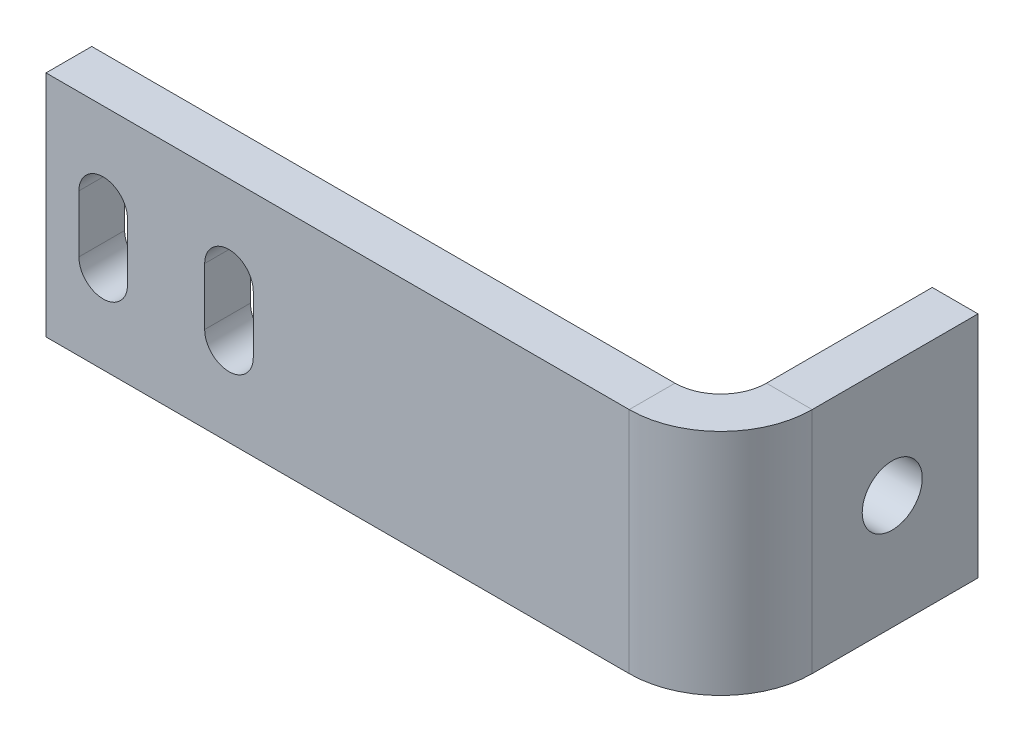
ISO-10303-21;
HEADER;
FILE_DESCRIPTION(('STEP AP214'),'2;1');
FILE_NAME('part.step','',(''),(''),'','','');
FILE_SCHEMA(('AUTOMOTIVE_DESIGN { 1 0 10303 214 1 1 1 1 }'));
ENDSEC;
DATA;
#1=APPLICATION_CONTEXT('core data for automotive mechanical design processes');
#2=APPLICATION_PROTOCOL_DEFINITION('international standard','automotive_design',2000,#1);
#3=PRODUCT_CONTEXT('',#1,'mechanical');
#4=PRODUCT('Part','Part','',(#3));
#5=PRODUCT_RELATED_PRODUCT_CATEGORY('part','',(#4));
#6=PRODUCT_DEFINITION_FORMATION('','',#4);
#7=PRODUCT_DEFINITION_CONTEXT('part definition',#1,'design');
#8=PRODUCT_DEFINITION('design','',#6,#7);
#9=PRODUCT_DEFINITION_SHAPE('','',#8);
#10=(LENGTH_UNIT() NAMED_UNIT(*) SI_UNIT(.MILLI.,.METRE.));
#11=(NAMED_UNIT(*) PLANE_ANGLE_UNIT() SI_UNIT($,.RADIAN.));
#12=(NAMED_UNIT(*) SI_UNIT($,.STERADIAN.) SOLID_ANGLE_UNIT());
#13=UNCERTAINTY_MEASURE_WITH_UNIT(LENGTH_MEASURE(1.E-05),#10,'distance_accuracy_value','');
#14=(GEOMETRIC_REPRESENTATION_CONTEXT(3) GLOBAL_UNCERTAINTY_ASSIGNED_CONTEXT((#13)) GLOBAL_UNIT_ASSIGNED_CONTEXT((#10,
#11,#12)) REPRESENTATION_CONTEXT('',''));
#15=CARTESIAN_POINT('',(0.,0.,0.));
#16=DIRECTION('',(0.,0.,1.));
#17=DIRECTION('',(1.,0.,0.));
#18=AXIS2_PLACEMENT_3D('',#15,#16,#17);
#19=CARTESIAN_POINT('',(0.,-20.,8.));
#20=DIRECTION('',(0.,1.,0.));
#21=DIRECTION('',(0.,0.,1.));
#22=AXIS2_PLACEMENT_3D('',#19,#20,#21);
#23=PLANE('',#22);
#24=DIRECTION('',(0.,0.,1.));
#25=VECTOR('',#24,1.);
#26=CARTESIAN_POINT('',(102.,-20.,0.));
#27=LINE('',#26,#25);
#28=CARTESIAN_POINT('',(102.,-20.,0.));
#29=VERTEX_POINT('',#28);
#30=CARTESIAN_POINT('',(102.,-20.,8.));
#31=VERTEX_POINT('',#30);
#32=EDGE_CURVE('E331',#29,#31,#27,.T.);
#33=ORIENTED_EDGE('',*,*,#32,.T.);
#34=DIRECTION('',(1.,0.,0.));
#35=VECTOR('',#34,1.);
#36=CARTESIAN_POINT('',(0.,-20.,8.));
#37=LINE('',#36,#35);
#38=CARTESIAN_POINT('',(0.,-20.,8.));
#39=VERTEX_POINT('',#38);
#40=EDGE_CURVE('E357',#39,#31,#37,.T.);
#41=ORIENTED_EDGE('',*,*,#40,.F.);
#42=DIRECTION('',(0.,0.,-1.));
#43=VECTOR('',#42,1.);
#44=CARTESIAN_POINT('',(0.,-20.,8.));
#45=LINE('',#44,#43);
#46=CARTESIAN_POINT('',(0.,-20.,0.));
#47=VERTEX_POINT('',#46);
#48=EDGE_CURVE('E13',#39,#47,#45,.T.);
#49=ORIENTED_EDGE('',*,*,#48,.T.);
#50=DIRECTION('',(1.,0.,0.));
#51=VECTOR('',#50,1.);
#52=CARTESIAN_POINT('',(0.,-20.,0.));
#53=LINE('',#52,#51);
#54=EDGE_CURVE('E346',#47,#29,#53,.T.);
#55=ORIENTED_EDGE('',*,*,#54,.T.);
#56=EDGE_LOOP('',(#33,#41,#49,#55));
#57=FACE_BOUND('',#56,.T.);
#58=ADVANCED_FACE('F58',(#57),#23,.F.);
#59=CARTESIAN_POINT('',(0.,20.,8.));
#60=DIRECTION('',(0.,-1.,0.));
#61=DIRECTION('',(0.,0.,-1.));
#62=AXIS2_PLACEMENT_3D('',#59,#60,#61);
#63=PLANE('',#62);
#64=DIRECTION('',(0.,0.,1.));
#65=VECTOR('',#64,1.);
#66=CARTESIAN_POINT('',(102.,20.,0.));
#67=LINE('',#66,#65);
#68=CARTESIAN_POINT('',(102.,20.,0.));
#69=VERTEX_POINT('',#68);
#70=CARTESIAN_POINT('',(102.,20.,8.));
#71=VERTEX_POINT('',#70);
#72=EDGE_CURVE('E335',#69,#71,#67,.T.);
#73=ORIENTED_EDGE('',*,*,#72,.F.);
#74=DIRECTION('',(-1.,0.,0.));
#75=VECTOR('',#74,1.);
#76=CARTESIAN_POINT('',(0.,20.,0.));
#77=LINE('',#76,#75);
#78=CARTESIAN_POINT('',(0.,20.,0.));
#79=VERTEX_POINT('',#78);
#80=EDGE_CURVE('E350',#69,#79,#77,.T.);
#81=ORIENTED_EDGE('',*,*,#80,.T.);
#82=DIRECTION('',(0.,0.,-1.));
#83=VECTOR('',#82,1.);
#84=CARTESIAN_POINT('',(0.,20.,8.));
#85=LINE('',#84,#83);
#86=CARTESIAN_POINT('',(0.,20.,8.));
#87=VERTEX_POINT('',#86);
#88=EDGE_CURVE('E67',#87,#79,#85,.T.);
#89=ORIENTED_EDGE('',*,*,#88,.F.);
#90=DIRECTION('',(-1.,0.,0.));
#91=VECTOR('',#90,1.);
#92=CARTESIAN_POINT('',(0.,20.,8.));
#93=LINE('',#92,#91);
#94=EDGE_CURVE('E361',#71,#87,#93,.T.);
#95=ORIENTED_EDGE('',*,*,#94,.F.);
#96=EDGE_LOOP('',(#73,#81,#89,#95));
#97=FACE_BOUND('',#96,.T.);
#98=ADVANCED_FACE('F379',(#97),#63,.F.);
#99=CARTESIAN_POINT('',(0.,-20.,8.));
#100=DIRECTION('',(0.,0.,1.));
#101=DIRECTION('',(1.,0.,0.));
#102=AXIS2_PLACEMENT_3D('',#99,#100,#101);
#103=PLANE('',#102);
#104=CARTESIAN_POINT('',(32.,5.,8.));
#105=DIRECTION('',(0.,0.,1.));
#106=DIRECTION('',(1.,0.,0.));
#107=AXIS2_PLACEMENT_3D('',#104,#105,#106);
#108=CIRCLE('',#107,4.25);
#109=CARTESIAN_POINT('',(27.75,5.,8.));
#110=VERTEX_POINT('',#109);
#111=CARTESIAN_POINT('',(36.25,5.,8.));
#112=VERTEX_POINT('',#111);
#113=EDGE_CURVE('E215',#110,#112,#108,.F.);
#114=ORIENTED_EDGE('',*,*,#113,.T.);
#115=DIRECTION('',(0.,-1.,0.));
#116=VECTOR('',#115,1.);
#117=CARTESIAN_POINT('',(36.25,5.,8.));
#118=LINE('',#117,#116);
#119=CARTESIAN_POINT('',(36.25,-5.00000000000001,8.));
#120=VERTEX_POINT('',#119);
#121=EDGE_CURVE('E182',#112,#120,#118,.T.);
#122=ORIENTED_EDGE('',*,*,#121,.T.);
#123=CARTESIAN_POINT('',(32.,-5.,8.));
#124=DIRECTION('',(0.,0.,1.));
#125=DIRECTION('',(1.,0.,0.));
#126=AXIS2_PLACEMENT_3D('',#123,#124,#125);
#127=CIRCLE('',#126,4.25);
#128=CARTESIAN_POINT('',(27.75,-5.,8.));
#129=VERTEX_POINT('',#128);
#130=EDGE_CURVE('E74',#120,#129,#127,.F.);
#131=ORIENTED_EDGE('',*,*,#130,.T.);
#132=DIRECTION('',(0.,1.,0.));
#133=VECTOR('',#132,1.);
#134=CARTESIAN_POINT('',(27.75,5.,8.));
#135=LINE('',#134,#133);
#136=EDGE_CURVE('E209',#129,#110,#135,.T.);
#137=ORIENTED_EDGE('',*,*,#136,.T.);
#138=EDGE_LOOP('',(#114,#122,#131,#137));
#139=FACE_BOUND('',#138,.T.);
#140=CARTESIAN_POINT('',(9.99999999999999,5.,8.));
#141=DIRECTION('',(0.,0.,1.));
#142=DIRECTION('',(1.,0.,0.));
#143=AXIS2_PLACEMENT_3D('',#140,#141,#142);
#144=CIRCLE('',#143,4.25);
#145=CARTESIAN_POINT('',(5.75000000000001,5.,8.));
#146=VERTEX_POINT('',#145);
#147=CARTESIAN_POINT('',(14.25,5.,8.));
#148=VERTEX_POINT('',#147);
#149=EDGE_CURVE('E226',#146,#148,#144,.F.);
#150=ORIENTED_EDGE('',*,*,#149,.T.);
#151=DIRECTION('',(0.,-1.,0.));
#152=VECTOR('',#151,1.);
#153=CARTESIAN_POINT('',(14.25,5.,8.));
#154=LINE('',#153,#152);
#155=CARTESIAN_POINT('',(14.25,-5.00000000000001,8.));
#156=VERTEX_POINT('',#155);
#157=EDGE_CURVE('E249',#148,#156,#154,.T.);
#158=ORIENTED_EDGE('',*,*,#157,.T.);
#159=CARTESIAN_POINT('',(9.99999999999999,-5.,8.));
#160=DIRECTION('',(0.,0.,1.));
#161=DIRECTION('',(1.,0.,0.));
#162=AXIS2_PLACEMENT_3D('',#159,#160,#161);
#163=CIRCLE('',#162,4.25);
#164=CARTESIAN_POINT('',(5.75,-5.,8.));
#165=VERTEX_POINT('',#164);
#166=EDGE_CURVE('E219',#156,#165,#163,.F.);
#167=ORIENTED_EDGE('',*,*,#166,.T.);
#168=DIRECTION('',(0.,1.,0.));
#169=VECTOR('',#168,1.);
#170=CARTESIAN_POINT('',(5.75000000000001,5.,8.));
#171=LINE('',#170,#169);
#172=EDGE_CURVE('E222',#165,#146,#171,.T.);
#173=ORIENTED_EDGE('',*,*,#172,.T.);
#174=EDGE_LOOP('',(#150,#158,#167,#173));
#175=FACE_BOUND('',#174,.T.);
#176=ORIENTED_EDGE('',*,*,#40,.T.);
#177=DIRECTION('',(0.,-1.,0.));
#178=VECTOR('',#177,1.);
#179=CARTESIAN_POINT('',(102.,-20.,8.));
#180=LINE('',#179,#178);
#181=EDGE_CURVE('E323',#31,#71,#180,.F.);
#182=ORIENTED_EDGE('',*,*,#181,.T.);
#183=ORIENTED_EDGE('',*,*,#94,.T.);
#184=DIRECTION('',(0.,-1.,0.));
#185=VECTOR('',#184,1.);
#186=CARTESIAN_POINT('',(0.,20.,8.));
#187=LINE('',#186,#185);
#188=EDGE_CURVE('E353',#87,#39,#187,.T.);
#189=ORIENTED_EDGE('',*,*,#188,.T.);
#190=EDGE_LOOP('',(#176,#182,#183,#189));
#191=FACE_BOUND('',#190,.T.);
#192=ADVANCED_FACE('F378',(#139,#175,#191),#103,.T.);
#193=CARTESIAN_POINT('',(0.,-20.,0.));
#194=DIRECTION('',(0.,0.,1.));
#195=DIRECTION('',(1.,0.,0.));
#196=AXIS2_PLACEMENT_3D('',#193,#194,#195);
#197=PLANE('',#196);
#198=DIRECTION('',(0.,-1.,0.));
#199=VECTOR('',#198,1.);
#200=CARTESIAN_POINT('',(36.25,5.,1.13686837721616E-10));
#201=LINE('',#200,#199);
#202=CARTESIAN_POINT('',(36.25,5.,0.));
#203=VERTEX_POINT('',#202);
#204=CARTESIAN_POINT('',(36.25,-5.,1.13686837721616E-10));
#205=VERTEX_POINT('',#204);
#206=EDGE_CURVE('E174',#203,#205,#201,.T.);
#207=ORIENTED_EDGE('',*,*,#206,.F.);
#208=CARTESIAN_POINT('',(32.,5.,1.13686837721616E-10));
#209=DIRECTION('',(0.,0.,-1.));
#210=DIRECTION('',(-1.,0.,0.));
#211=AXIS2_PLACEMENT_3D('',#208,#209,#210);
#212=CIRCLE('',#211,4.25);
#213=CARTESIAN_POINT('',(27.75,5.,1.13686837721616E-10));
#214=VERTEX_POINT('',#213);
#215=EDGE_CURVE('E82',#214,#203,#212,.T.);
#216=ORIENTED_EDGE('',*,*,#215,.F.);
#217=DIRECTION('',(0.,1.,0.));
#218=VECTOR('',#217,1.);
#219=CARTESIAN_POINT('',(27.75,5.,1.13686837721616E-10));
#220=LINE('',#219,#218);
#221=CARTESIAN_POINT('',(27.75,-5.,1.13686837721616E-10));
#222=VERTEX_POINT('',#221);
#223=EDGE_CURVE('E192',#222,#214,#220,.T.);
#224=ORIENTED_EDGE('',*,*,#223,.F.);
#225=CARTESIAN_POINT('',(32.,-5.,1.13686837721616E-10));
#226=DIRECTION('',(0.,0.,-1.));
#227=DIRECTION('',(-1.,0.,0.));
#228=AXIS2_PLACEMENT_3D('',#225,#226,#227);
#229=CIRCLE('',#228,4.25);
#230=EDGE_CURVE('E185',#205,#222,#229,.T.);
#231=ORIENTED_EDGE('',*,*,#230,.F.);
#232=EDGE_LOOP('',(#207,#216,#224,#231));
#233=FACE_BOUND('',#232,.T.);
#234=DIRECTION('',(0.,-1.,0.));
#235=VECTOR('',#234,1.);
#236=CARTESIAN_POINT('',(14.25,5.,1.13686837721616E-10));
#237=LINE('',#236,#235);
#238=CARTESIAN_POINT('',(14.25,5.,0.));
#239=VERTEX_POINT('',#238);
#240=CARTESIAN_POINT('',(14.25,-5.,1.13686837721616E-10));
#241=VERTEX_POINT('',#240);
#242=EDGE_CURVE('E233',#239,#241,#237,.T.);
#243=ORIENTED_EDGE('',*,*,#242,.F.);
#244=CARTESIAN_POINT('',(9.99999999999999,5.,1.13686837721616E-10));
#245=DIRECTION('',(0.,0.,-1.));
#246=DIRECTION('',(-1.,0.,0.));
#247=AXIS2_PLACEMENT_3D('',#244,#245,#246);
#248=CIRCLE('',#247,4.25);
#249=CARTESIAN_POINT('',(5.75000000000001,5.,1.13686837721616E-10));
#250=VERTEX_POINT('',#249);
#251=EDGE_CURVE('E230',#250,#239,#248,.T.);
#252=ORIENTED_EDGE('',*,*,#251,.F.);
#253=DIRECTION('',(0.,1.,0.));
#254=VECTOR('',#253,1.);
#255=CARTESIAN_POINT('',(5.75000000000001,5.,1.13686837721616E-10));
#256=LINE('',#255,#254);
#257=CARTESIAN_POINT('',(5.75,-5.,1.13686837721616E-10));
#258=VERTEX_POINT('',#257);
#259=EDGE_CURVE('E241',#258,#250,#256,.T.);
#260=ORIENTED_EDGE('',*,*,#259,.F.);
#261=CARTESIAN_POINT('',(9.99999999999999,-5.,1.13686837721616E-10));
#262=DIRECTION('',(0.,0.,-1.));
#263=DIRECTION('',(-1.,0.,0.));
#264=AXIS2_PLACEMENT_3D('',#261,#262,#263);
#265=CIRCLE('',#264,4.25);
#266=EDGE_CURVE('E237',#241,#258,#265,.T.);
#267=ORIENTED_EDGE('',*,*,#266,.F.);
#268=EDGE_LOOP('',(#243,#252,#260,#267));
#269=FACE_BOUND('',#268,.T.);
#270=DIRECTION('',(0.,-1.,0.));
#271=VECTOR('',#270,1.);
#272=CARTESIAN_POINT('',(102.,-20.,0.));
#273=LINE('',#272,#271);
#274=EDGE_CURVE('E317',#29,#69,#273,.F.);
#275=ORIENTED_EDGE('',*,*,#274,.F.);
#276=ORIENTED_EDGE('',*,*,#54,.F.);
#277=DIRECTION('',(0.,-1.,0.));
#278=VECTOR('',#277,1.);
#279=CARTESIAN_POINT('',(0.,20.,0.));
#280=LINE('',#279,#278);
#281=EDGE_CURVE('E339',#79,#47,#280,.T.);
#282=ORIENTED_EDGE('',*,*,#281,.F.);
#283=ORIENTED_EDGE('',*,*,#80,.F.);
#284=EDGE_LOOP('',(#275,#276,#282,#283));
#285=FACE_BOUND('',#284,.T.);
#286=ADVANCED_FACE('F190',(#233,#269,#285),#197,.F.);
#287=CARTESIAN_POINT('',(0.,20.,8.));
#288=DIRECTION('',(1.,0.,0.));
#289=DIRECTION('',(0.,0.,-1.));
#290=AXIS2_PLACEMENT_3D('',#287,#288,#289);
#291=PLANE('',#290);
#292=ORIENTED_EDGE('',*,*,#281,.T.);
#293=ORIENTED_EDGE('',*,*,#48,.F.);
#294=ORIENTED_EDGE('',*,*,#188,.F.);
#295=ORIENTED_EDGE('',*,*,#88,.T.);
#296=EDGE_LOOP('',(#292,#293,#294,#295));
#297=FACE_BOUND('',#296,.T.);
#298=ADVANCED_FACE('F60',(#297),#291,.F.);
#299=CARTESIAN_POINT('',(102.,20.,-8.00000000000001));
#300=DIRECTION('',(0.,1.,0.));
#301=DIRECTION('',(0.,0.,1.));
#302=AXIS2_PLACEMENT_3D('',#299,#300,#301);
#303=PLANE('',#302);
#304=DIRECTION('',(-1.,0.,0.));
#305=VECTOR('',#304,1.);
#306=CARTESIAN_POINT('',(118.,20.,-7.99999999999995));
#307=LINE('',#306,#305);
#308=CARTESIAN_POINT('',(110.,20.,-7.99999999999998));
#309=VERTEX_POINT('',#308);
#310=CARTESIAN_POINT('',(118.,20.,-7.99999999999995));
#311=VERTEX_POINT('',#310);
#312=EDGE_CURVE('E270',#309,#311,#307,.F.);
#313=ORIENTED_EDGE('',*,*,#312,.F.);
#314=CARTESIAN_POINT('',(102.,20.,-8.00000000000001));
#315=DIRECTION('',(0.,-1.,0.));
#316=DIRECTION('',(0.,0.,-1.));
#317=AXIS2_PLACEMENT_3D('',#314,#315,#316);
#318=CIRCLE('',#317,8.00000000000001);
#319=EDGE_CURVE('E312',#69,#309,#318,.F.);
#320=ORIENTED_EDGE('',*,*,#319,.F.);
#321=ORIENTED_EDGE('',*,*,#72,.T.);
#322=CARTESIAN_POINT('',(102.,20.,-8.00000000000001));
#323=DIRECTION('',(0.,-1.,0.));
#324=DIRECTION('',(0.,0.,-1.));
#325=AXIS2_PLACEMENT_3D('',#322,#323,#324);
#326=CIRCLE('',#325,16.);
#327=EDGE_CURVE('E327',#71,#311,#326,.F.);
#328=ORIENTED_EDGE('',*,*,#327,.T.);
#329=EDGE_LOOP('',(#313,#320,#321,#328));
#330=FACE_BOUND('',#329,.T.);
#331=ADVANCED_FACE('F382',(#330),#303,.T.);
#332=CARTESIAN_POINT('',(102.,-20.,-8.00000000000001));
#333=DIRECTION('',(0.,1.,0.));
#334=DIRECTION('',(0.,0.,1.));
#335=AXIS2_PLACEMENT_3D('',#332,#333,#334);
#336=PLANE('',#335);
#337=CARTESIAN_POINT('',(102.,-20.,-8.00000000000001));
#338=DIRECTION('',(0.,-1.,0.));
#339=DIRECTION('',(0.,0.,-1.));
#340=AXIS2_PLACEMENT_3D('',#337,#338,#339);
#341=CIRCLE('',#340,8.00000000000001);
#342=CARTESIAN_POINT('',(110.,-20.,-7.99999999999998));
#343=VERTEX_POINT('',#342);
#344=EDGE_CURVE('E275',#343,#29,#341,.T.);
#345=ORIENTED_EDGE('',*,*,#344,.F.);
#346=DIRECTION('',(-1.,0.,0.));
#347=VECTOR('',#346,1.);
#348=CARTESIAN_POINT('',(110.,-20.,-7.99999999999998));
#349=LINE('',#348,#347);
#350=CARTESIAN_POINT('',(118.,-20.,-7.99999999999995));
#351=VERTEX_POINT('',#350);
#352=EDGE_CURVE('E302',#343,#351,#349,.F.);
#353=ORIENTED_EDGE('',*,*,#352,.T.);
#354=CARTESIAN_POINT('',(102.,-20.,-8.00000000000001));
#355=DIRECTION('',(0.,-1.,0.));
#356=DIRECTION('',(0.,0.,-1.));
#357=AXIS2_PLACEMENT_3D('',#354,#355,#356);
#358=CIRCLE('',#357,16.);
#359=EDGE_CURVE('E316',#351,#31,#358,.T.);
#360=ORIENTED_EDGE('',*,*,#359,.T.);
#361=ORIENTED_EDGE('',*,*,#32,.F.);
#362=EDGE_LOOP('',(#345,#353,#360,#361));
#363=FACE_BOUND('',#362,.T.);
#364=ADVANCED_FACE('F406',(#363),#336,.F.);
#365=CARTESIAN_POINT('',(102.,-20.,-8.00000000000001));
#366=DIRECTION('',(0.,-1.,0.));
#367=DIRECTION('',(1.,0.,0.));
#368=AXIS2_PLACEMENT_3D('',#365,#366,#367);
#369=CYLINDRICAL_SURFACE('',#368,16.);
#370=ORIENTED_EDGE('',*,*,#181,.F.);
#371=ORIENTED_EDGE('',*,*,#359,.F.);
#372=DIRECTION('',(0.,-1.,0.));
#373=VECTOR('',#372,1.);
#374=CARTESIAN_POINT('',(118.,20.,-7.99999999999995));
#375=LINE('',#374,#373);
#376=EDGE_CURVE('E299',#351,#311,#375,.F.);
#377=ORIENTED_EDGE('',*,*,#376,.T.);
#378=ORIENTED_EDGE('',*,*,#327,.F.);
#379=EDGE_LOOP('',(#370,#371,#377,#378));
#380=FACE_BOUND('',#379,.T.);
#381=ADVANCED_FACE('F410',(#380),#369,.T.);
#382=CARTESIAN_POINT('',(102.,-20.,-8.00000000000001));
#383=DIRECTION('',(0.,-1.,0.));
#384=DIRECTION('',(1.,0.,0.));
#385=AXIS2_PLACEMENT_3D('',#382,#383,#384);
#386=CYLINDRICAL_SURFACE('',#385,8.00000000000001);
#387=ORIENTED_EDGE('',*,*,#274,.T.);
#388=ORIENTED_EDGE('',*,*,#319,.T.);
#389=DIRECTION('',(0.,-1.,0.));
#390=VECTOR('',#389,1.);
#391=CARTESIAN_POINT('',(110.,20.,-7.99999999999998));
#392=LINE('',#391,#390);
#393=EDGE_CURVE('E306',#309,#343,#392,.T.);
#394=ORIENTED_EDGE('',*,*,#393,.T.);
#395=ORIENTED_EDGE('',*,*,#344,.T.);
#396=EDGE_LOOP('',(#387,#388,#394,#395));
#397=FACE_BOUND('',#396,.T.);
#398=ADVANCED_FACE('F385',(#397),#386,.F.);
#399=CARTESIAN_POINT('',(118.,-20.,-37.));
#400=DIRECTION('',(0.,1.,0.));
#401=DIRECTION('',(0.,0.,1.));
#402=AXIS2_PLACEMENT_3D('',#399,#400,#401);
#403=PLANE('',#402);
#404=ORIENTED_EDGE('',*,*,#352,.F.);
#405=DIRECTION('',(0.,0.,1.));
#406=VECTOR('',#405,1.);
#407=CARTESIAN_POINT('',(110.,-20.,-37.));
#408=LINE('',#407,#406);
#409=CARTESIAN_POINT('',(110.,-20.,-37.));
#410=VERTEX_POINT('',#409);
#411=EDGE_CURVE('E296',#343,#410,#408,.F.);
#412=ORIENTED_EDGE('',*,*,#411,.T.);
#413=DIRECTION('',(-1.,0.,0.));
#414=VECTOR('',#413,1.);
#415=CARTESIAN_POINT('',(118.,-20.,-37.));
#416=LINE('',#415,#414);
#417=CARTESIAN_POINT('',(118.,-20.,-37.));
#418=VERTEX_POINT('',#417);
#419=EDGE_CURVE('E271',#418,#410,#416,.T.);
#420=ORIENTED_EDGE('',*,*,#419,.F.);
#421=DIRECTION('',(0.,0.,-1.));
#422=VECTOR('',#421,1.);
#423=CARTESIAN_POINT('',(118.,-20.,0.));
#424=LINE('',#423,#422);
#425=EDGE_CURVE('E287',#351,#418,#424,.T.);
#426=ORIENTED_EDGE('',*,*,#425,.F.);
#427=EDGE_LOOP('',(#404,#412,#420,#426));
#428=FACE_BOUND('',#427,.T.);
#429=ADVANCED_FACE('F403',(#428),#403,.F.);
#430=CARTESIAN_POINT('',(118.,20.,0.));
#431=DIRECTION('',(0.,-1.,0.));
#432=DIRECTION('',(0.,0.,-1.));
#433=AXIS2_PLACEMENT_3D('',#430,#431,#432);
#434=PLANE('',#433);
#435=ORIENTED_EDGE('',*,*,#312,.T.);
#436=DIRECTION('',(0.,0.,1.));
#437=VECTOR('',#436,1.);
#438=CARTESIAN_POINT('',(118.,20.,0.));
#439=LINE('',#438,#437);
#440=CARTESIAN_POINT('',(118.,20.,-37.));
#441=VERTEX_POINT('',#440);
#442=EDGE_CURVE('E280',#441,#311,#439,.T.);
#443=ORIENTED_EDGE('',*,*,#442,.F.);
#444=DIRECTION('',(-1.,0.,0.));
#445=VECTOR('',#444,1.);
#446=CARTESIAN_POINT('',(118.,20.,-37.));
#447=LINE('',#446,#445);
#448=CARTESIAN_POINT('',(110.,20.,-37.));
#449=VERTEX_POINT('',#448);
#450=EDGE_CURVE('E276',#441,#449,#447,.T.);
#451=ORIENTED_EDGE('',*,*,#450,.T.);
#452=DIRECTION('',(0.,0.,-1.));
#453=VECTOR('',#452,1.);
#454=CARTESIAN_POINT('',(110.,20.,0.));
#455=LINE('',#454,#453);
#456=EDGE_CURVE('E290',#449,#309,#455,.F.);
#457=ORIENTED_EDGE('',*,*,#456,.T.);
#458=EDGE_LOOP('',(#435,#443,#451,#457));
#459=FACE_BOUND('',#458,.T.);
#460=ADVANCED_FACE('F393',(#459),#434,.F.);
#461=CARTESIAN_POINT('',(118.,-20.,0.));
#462=DIRECTION('',(-1.,0.,0.));
#463=DIRECTION('',(0.,0.,1.));
#464=AXIS2_PLACEMENT_3D('',#461,#462,#463);
#465=PLANE('',#464);
#466=CARTESIAN_POINT('',(118.,0.,-21.9999999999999));
#467=DIRECTION('',(-1.,0.,0.));
#468=DIRECTION('',(0.,0.,1.));
#469=AXIS2_PLACEMENT_3D('',#466,#467,#468);
#470=CIRCLE('',#469,5.25);
#471=CARTESIAN_POINT('',(118.,0.,-16.7499999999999));
#472=VERTEX_POINT('',#471);
#473=EDGE_CURVE('E262',#472,#472,#470,.T.);
#474=ORIENTED_EDGE('',*,*,#473,.T.);
#475=EDGE_LOOP('',(#474));
#476=FACE_BOUND('',#475,.T.);
#477=ORIENTED_EDGE('',*,*,#376,.F.);
#478=ORIENTED_EDGE('',*,*,#425,.T.);
#479=DIRECTION('',(0.,1.,0.));
#480=VECTOR('',#479,1.);
#481=CARTESIAN_POINT('',(118.,-20.,-37.));
#482=LINE('',#481,#480);
#483=EDGE_CURVE('E284',#418,#441,#482,.T.);
#484=ORIENTED_EDGE('',*,*,#483,.T.);
#485=ORIENTED_EDGE('',*,*,#442,.T.);
#486=EDGE_LOOP('',(#477,#478,#484,#485));
#487=FACE_BOUND('',#486,.T.);
#488=ADVANCED_FACE('F408',(#476,#487),#465,.F.);
#489=CARTESIAN_POINT('',(110.,-20.,0.));
#490=DIRECTION('',(-1.,0.,0.));
#491=DIRECTION('',(0.,0.,1.));
#492=AXIS2_PLACEMENT_3D('',#489,#490,#491);
#493=PLANE('',#492);
#494=CARTESIAN_POINT('',(110.,0.,-21.9999999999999));
#495=DIRECTION('',(-1.,0.,0.));
#496=DIRECTION('',(0.,0.,1.));
#497=AXIS2_PLACEMENT_3D('',#494,#495,#496);
#498=CIRCLE('',#497,5.25);
#499=CARTESIAN_POINT('',(110.,0.,-16.7499999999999));
#500=VERTEX_POINT('',#499);
#501=EDGE_CURVE('E266',#500,#500,#498,.T.);
#502=ORIENTED_EDGE('',*,*,#501,.F.);
#503=EDGE_LOOP('',(#502));
#504=FACE_BOUND('',#503,.T.);
#505=ORIENTED_EDGE('',*,*,#411,.F.);
#506=ORIENTED_EDGE('',*,*,#393,.F.);
#507=ORIENTED_EDGE('',*,*,#456,.F.);
#508=DIRECTION('',(0.,-1.,0.));
#509=VECTOR('',#508,1.);
#510=CARTESIAN_POINT('',(110.,20.,-37.));
#511=LINE('',#510,#509);
#512=EDGE_CURVE('E293',#410,#449,#511,.F.);
#513=ORIENTED_EDGE('',*,*,#512,.F.);
#514=EDGE_LOOP('',(#505,#506,#507,#513));
#515=FACE_BOUND('',#514,.T.);
#516=ADVANCED_FACE('F390',(#504,#515),#493,.T.);
#517=CARTESIAN_POINT('',(118.,20.,-37.));
#518=DIRECTION('',(0.,0.,1.));
#519=DIRECTION('',(1.,0.,0.));
#520=AXIS2_PLACEMENT_3D('',#517,#518,#519);
#521=PLANE('',#520);
#522=ORIENTED_EDGE('',*,*,#512,.T.);
#523=ORIENTED_EDGE('',*,*,#450,.F.);
#524=ORIENTED_EDGE('',*,*,#483,.F.);
#525=ORIENTED_EDGE('',*,*,#419,.T.);
#526=EDGE_LOOP('',(#522,#523,#524,#525));
#527=FACE_BOUND('',#526,.T.);
#528=ADVANCED_FACE('F398',(#527),#521,.F.);
#529=CARTESIAN_POINT('',(110.,0.,-21.9999999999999));
#530=DIRECTION('',(-1.,0.,0.));
#531=DIRECTION('',(0.,0.,1.));
#532=AXIS2_PLACEMENT_3D('',#529,#530,#531);
#533=CYLINDRICAL_SURFACE('',#532,5.25);
#534=ORIENTED_EDGE('',*,*,#473,.F.);
#535=EDGE_LOOP('',(#534));
#536=FACE_BOUND('',#535,.T.);
#537=ORIENTED_EDGE('',*,*,#501,.T.);
#538=EDGE_LOOP('',(#537));
#539=FACE_BOUND('',#538,.T.);
#540=ADVANCED_FACE('F488',(#536,#539),#533,.F.);
#541=CARTESIAN_POINT('',(9.99999999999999,5.,8.001));
#542=DIRECTION('',(0.,0.,-1.));
#543=DIRECTION('',(-1.,0.,0.));
#544=AXIS2_PLACEMENT_3D('',#541,#542,#543);
#545=CYLINDRICAL_SURFACE('',#544,4.25);
#546=DIRECTION('',(0.,0.,-1.));
#547=VECTOR('',#546,1.);
#548=CARTESIAN_POINT('',(5.75000000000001,5.,8.001));
#549=LINE('',#548,#547);
#550=EDGE_CURVE('E246',#146,#250,#549,.T.);
#551=ORIENTED_EDGE('',*,*,#550,.T.);
#552=ORIENTED_EDGE('',*,*,#251,.T.);
#553=DIRECTION('',(0.,0.,-1.));
#554=VECTOR('',#553,1.);
#555=CARTESIAN_POINT('',(14.25,5.,8.001));
#556=LINE('',#555,#554);
#557=EDGE_CURVE('E245',#148,#239,#556,.T.);
#558=ORIENTED_EDGE('',*,*,#557,.F.);
#559=ORIENTED_EDGE('',*,*,#149,.F.);
#560=EDGE_LOOP('',(#551,#552,#558,#559));
#561=FACE_BOUND('',#560,.T.);
#562=ADVANCED_FACE('F495',(#561),#545,.F.);
#563=CARTESIAN_POINT('',(5.75000000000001,5.,8.001));
#564=DIRECTION('',(-1.,0.,0.));
#565=DIRECTION('',(0.,0.,1.));
#566=AXIS2_PLACEMENT_3D('',#563,#564,#565);
#567=PLANE('',#566);
#568=DIRECTION('',(0.,0.,-1.));
#569=VECTOR('',#568,1.);
#570=CARTESIAN_POINT('',(5.75,-5.,8.001));
#571=LINE('',#570,#569);
#572=EDGE_CURVE('E250',#165,#258,#571,.T.);
#573=ORIENTED_EDGE('',*,*,#572,.T.);
#574=ORIENTED_EDGE('',*,*,#259,.T.);
#575=ORIENTED_EDGE('',*,*,#550,.F.);
#576=ORIENTED_EDGE('',*,*,#172,.F.);
#577=EDGE_LOOP('',(#573,#574,#575,#576));
#578=FACE_BOUND('',#577,.T.);
#579=ADVANCED_FACE('F504',(#578),#567,.F.);
#580=CARTESIAN_POINT('',(9.99999999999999,-5.,8.001));
#581=DIRECTION('',(0.,0.,-1.));
#582=DIRECTION('',(-1.,0.,0.));
#583=AXIS2_PLACEMENT_3D('',#580,#581,#582);
#584=CYLINDRICAL_SURFACE('',#583,4.25);
#585=DIRECTION('',(0.,0.,-1.));
#586=VECTOR('',#585,1.);
#587=CARTESIAN_POINT('',(14.25,-5.,8.001));
#588=LINE('',#587,#586);
#589=EDGE_CURVE('E253',#156,#241,#588,.T.);
#590=ORIENTED_EDGE('',*,*,#589,.T.);
#591=ORIENTED_EDGE('',*,*,#266,.T.);
#592=ORIENTED_EDGE('',*,*,#572,.F.);
#593=ORIENTED_EDGE('',*,*,#166,.F.);
#594=EDGE_LOOP('',(#590,#591,#592,#593));
#595=FACE_BOUND('',#594,.T.);
#596=ADVANCED_FACE('F513',(#595),#584,.F.);
#597=CARTESIAN_POINT('',(14.25,5.,8.001));
#598=DIRECTION('',(1.,0.,0.));
#599=DIRECTION('',(0.,0.,-1.));
#600=AXIS2_PLACEMENT_3D('',#597,#598,#599);
#601=PLANE('',#600);
#602=ORIENTED_EDGE('',*,*,#557,.T.);
#603=ORIENTED_EDGE('',*,*,#242,.T.);
#604=ORIENTED_EDGE('',*,*,#589,.F.);
#605=ORIENTED_EDGE('',*,*,#157,.F.);
#606=EDGE_LOOP('',(#602,#603,#604,#605));
#607=FACE_BOUND('',#606,.T.);
#608=ADVANCED_FACE('F522',(#607),#601,.F.);
#609=CARTESIAN_POINT('',(32.,5.,8.001));
#610=DIRECTION('',(0.,0.,-1.));
#611=DIRECTION('',(-1.,0.,0.));
#612=AXIS2_PLACEMENT_3D('',#609,#610,#611);
#613=CYLINDRICAL_SURFACE('',#612,4.25);
#614=DIRECTION('',(0.,0.,-1.));
#615=VECTOR('',#614,1.);
#616=CARTESIAN_POINT('',(27.75,5.,8.001));
#617=LINE('',#616,#615);
#618=EDGE_CURVE('E206',#110,#214,#617,.T.);
#619=ORIENTED_EDGE('',*,*,#618,.T.);
#620=ORIENTED_EDGE('',*,*,#215,.T.);
#621=DIRECTION('',(0.,0.,-1.));
#622=VECTOR('',#621,1.);
#623=CARTESIAN_POINT('',(36.25,5.,8.001));
#624=LINE('',#623,#622);
#625=EDGE_CURVE('E178',#112,#203,#624,.T.);
#626=ORIENTED_EDGE('',*,*,#625,.F.);
#627=ORIENTED_EDGE('',*,*,#113,.F.);
#628=EDGE_LOOP('',(#619,#620,#626,#627));
#629=FACE_BOUND('',#628,.T.);
#630=ADVANCED_FACE('F531',(#629),#613,.F.);
#631=CARTESIAN_POINT('',(27.75,5.,8.001));
#632=DIRECTION('',(-1.,0.,0.));
#633=DIRECTION('',(0.,0.,1.));
#634=AXIS2_PLACEMENT_3D('',#631,#632,#633);
#635=PLANE('',#634);
#636=DIRECTION('',(0.,0.,-1.));
#637=VECTOR('',#636,1.);
#638=CARTESIAN_POINT('',(27.75,-5.,8.001));
#639=LINE('',#638,#637);
#640=EDGE_CURVE('E194',#129,#222,#639,.T.);
#641=ORIENTED_EDGE('',*,*,#640,.T.);
#642=ORIENTED_EDGE('',*,*,#223,.T.);
#643=ORIENTED_EDGE('',*,*,#618,.F.);
#644=ORIENTED_EDGE('',*,*,#136,.F.);
#645=EDGE_LOOP('',(#641,#642,#643,#644));
#646=FACE_BOUND('',#645,.T.);
#647=ADVANCED_FACE('F541',(#646),#635,.F.);
#648=CARTESIAN_POINT('',(32.,-5.,8.001));
#649=DIRECTION('',(0.,0.,-1.));
#650=DIRECTION('',(-1.,0.,0.));
#651=AXIS2_PLACEMENT_3D('',#648,#649,#650);
#652=CYLINDRICAL_SURFACE('',#651,4.25);
#653=DIRECTION('',(0.,0.,-1.));
#654=VECTOR('',#653,1.);
#655=CARTESIAN_POINT('',(36.25,-5.,8.001));
#656=LINE('',#655,#654);
#657=EDGE_CURVE('E176',#120,#205,#656,.T.);
#658=ORIENTED_EDGE('',*,*,#657,.T.);
#659=ORIENTED_EDGE('',*,*,#230,.T.);
#660=ORIENTED_EDGE('',*,*,#640,.F.);
#661=ORIENTED_EDGE('',*,*,#130,.F.);
#662=EDGE_LOOP('',(#658,#659,#660,#661));
#663=FACE_BOUND('',#662,.T.);
#664=ADVANCED_FACE('F184',(#663),#652,.F.);
#665=CARTESIAN_POINT('',(36.25,5.,8.001));
#666=DIRECTION('',(1.,0.,0.));
#667=DIRECTION('',(0.,0.,-1.));
#668=AXIS2_PLACEMENT_3D('',#665,#666,#667);
#669=PLANE('',#668);
#670=ORIENTED_EDGE('',*,*,#625,.T.);
#671=ORIENTED_EDGE('',*,*,#206,.T.);
#672=ORIENTED_EDGE('',*,*,#657,.F.);
#673=ORIENTED_EDGE('',*,*,#121,.F.);
#674=EDGE_LOOP('',(#670,#671,#672,#673));
#675=FACE_BOUND('',#674,.T.);
#676=ADVANCED_FACE('F175',(#675),#669,.F.);
#677=CLOSED_SHELL('',(#58,#98,#192,#286,#298,#331,#364,#381,#398,#429,#460,#488,#516,#528,#540,
#562,#579,#596,#608,#630,#647,#664,#676));
#678=MANIFOLD_SOLID_BREP('B2',#677);
#679=ADVANCED_BREP_SHAPE_REPRESENTATION('',(#18,#678),#14);
#680=SHAPE_DEFINITION_REPRESENTATION(#9,#679);
ENDSEC;
END-ISO-10303-21;
